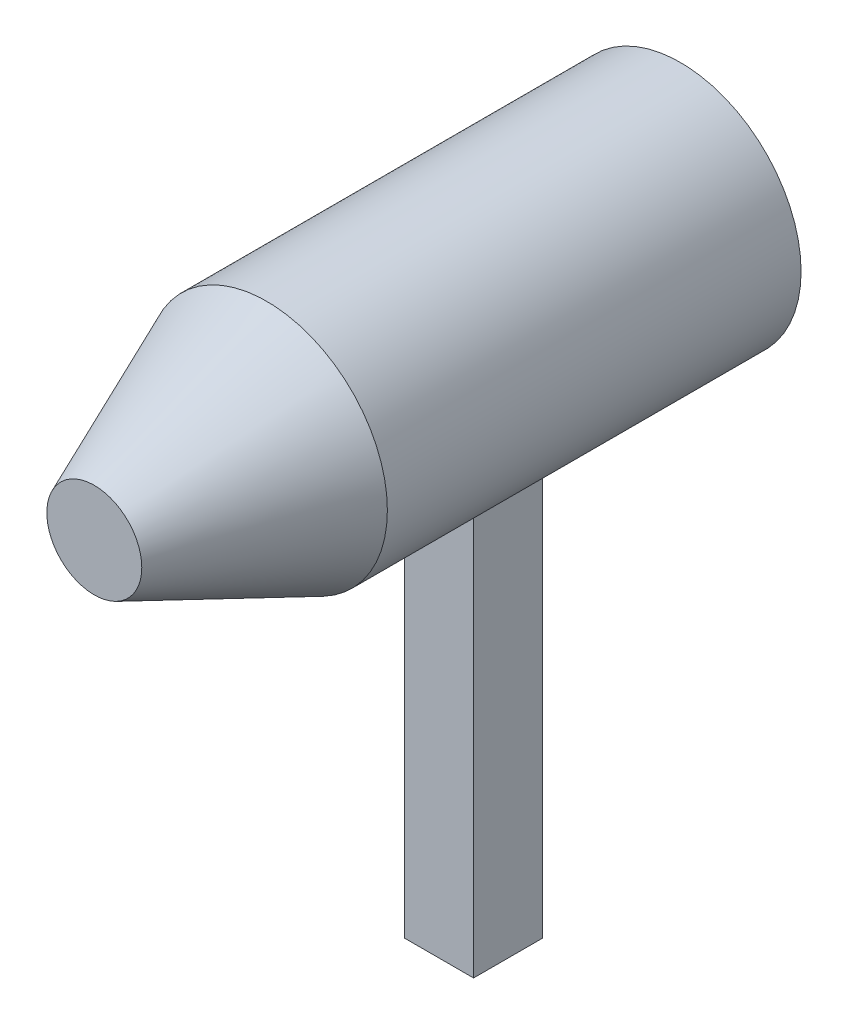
from build123d import *

# Parameters (mm, degrees)
SKETCH3_R           = 35
BOSS_EXTRUDE2_DEPTH = 50.01
BOSS_EXTRUDE2_TAPER = 23
SKETCH4_R           = 35
BOSS_EXTRUDE3_DEPTH = 120
SKETCH5_W           = 20
SKETCH5_H           = 20
BOSS_EXTRUDE4_DEPTH = 120


with BuildPart() as part:
    # Sketch3 → Boss-Extrude2 (new body)
    with BuildSketch(Plane.XY):
        Circle(SKETCH3_R)
    extrude(amount=BOSS_EXTRUDE2_DEPTH, taper=BOSS_EXTRUDE2_TAPER)

    # Sketch4 → Boss-Extrude3 (add)
    with BuildSketch(Plane(origin=(0, 0, 0), x_dir=(-1, 0, 0), z_dir=(0, 0, -1))):
        Circle(SKETCH4_R)
    extrude(amount=BOSS_EXTRUDE3_DEPTH)


with BuildPart() as body_2:
    # Sketch5 → Boss-Extrude4 (new body)
    with BuildSketch(Plane(origin=(0, -35, 0), x_dir=(1, 0, 0), z_dir=(0, 1, 0))):
        with Locations((0, 60)):
            Rectangle(SKETCH5_W, SKETCH5_H)
    extrude(amount=-BOSS_EXTRUDE4_DEPTH)


solid = Compound([part.part, body_2.part])
